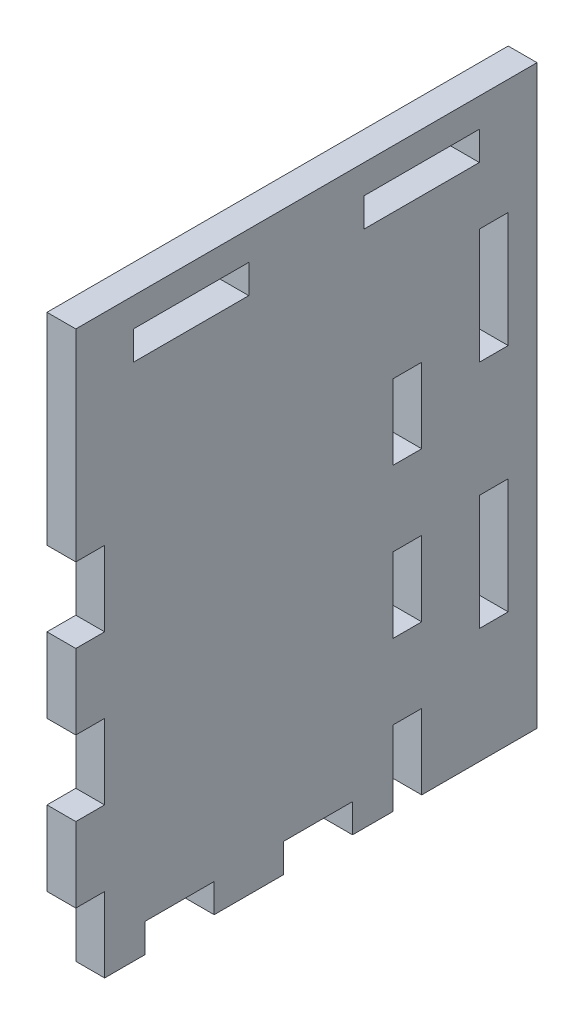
from build123d import *

# Parameters (mm, degrees)
BOSS_EXTRU_1_DEPTH         = 5
ESQUISSE2_W                = 12
ESQUISSE2_H                = 5
ENL_V_MAT_EXTRU_1_DEPTH    = 5
R_P_TITION_LIN_AIRE1_COUNT = 2
R_P_TITION_LIN_AIRE1_PITCH = 24
ESQUISSE4_W                = 5
ESQUISSE4_H                = 13
ENL_V_MAT_EXTRU_2_DEPTH    = 5
R_P_TITION_LIN_AIRE2_COUNT = 3
R_P_TITION_LIN_AIRE2_PITCH = 26
SYM_TRIE1_COPY_1_SKETCH_W  = 5
SYM_TRIE1_COPY_1_SKETCH_H  = 13
SYM_TRIE1_COPY_1_DEPTH     = 5
SYM_TRIE1_COPY_2_SKETCH_W  = 5
SYM_TRIE1_COPY_2_SKETCH_H  = 13
SYM_TRIE1_COPY_2_DEPTH     = 5
BOSS_EXTRU_3_DEPTH         = 5
ESQUISSE7_W                = 20
ESQUISSE7_H                = 5
ENL_V_MAT_EXTRU_3_DEPTH    = 5
ESQUISSE8_W                = 5
ESQUISSE8_H                = 20
ENL_V_MAT_EXTRU_4_DEPTH    = 5


with BuildPart() as part:
    # Esquisse1 → Boss.-Extru.1 (new body)
    with BuildSketch(Plane(origin=(0, 0, 0), x_dir=(0, 0, -1), z_dir=(1, 0, 0))):
        Polygon((0, 0), (0, 35), (45, 35), (45, 0), (60, 0), (60, -65), (0, -65), align=None)
    extrude(amount=BOSS_EXTRU_1_DEPTH)

    # Esquisse2 → Enl_v. mat.-Extru.1 (cut)
    with BuildSketch(Plane(origin=(5, 0, 0), x_dir=(0, 0, -1), z_dir=(1, 0, 0))):
        with Locations((18, -62.5)):
            Rectangle(ESQUISSE2_W, ESQUISSE2_H)
    enl_v_mat_extru_1 = extrude(amount=-ENL_V_MAT_EXTRU_1_DEPTH, mode=Mode.SUBTRACT)

    # R_p_tition lin_aire1: Enl_v. mat.-Extru.1 ×2
    with Locations(*[(0, 0, -i * R_P_TITION_LIN_AIRE1_PITCH) for i in range(1, R_P_TITION_LIN_AIRE1_COUNT)]):
        add(enl_v_mat_extru_1, mode=Mode.SUBTRACT)

    # Esquisse4 → Enl_v. mat.-Extru.2 (cut)
    with BuildSketch(Plane(origin=(5, 0, 0), x_dir=(0, 0, -1), z_dir=(1, 0, 0))):
        with Locations((2.5, -58.5)):
            Rectangle(ESQUISSE4_W, ESQUISSE4_H)
    enl_v_mat_extru_2 = extrude(amount=-ENL_V_MAT_EXTRU_2_DEPTH, mode=Mode.SUBTRACT)

    # R_p_tition lin_aire2: Enl_v. mat.-Extru.2 ×3
    with Locations(*[(0, i * R_P_TITION_LIN_AIRE2_PITCH, 0) for i in range(1, R_P_TITION_LIN_AIRE2_COUNT)]):
        add(enl_v_mat_extru_2, mode=Mode.SUBTRACT)

    # Sym_trie1: Enl_v. mat.-Extru.2 across plane
    add(enl_v_mat_extru_2.mirror(Plane.XY.offset(-30)), mode=Mode.SUBTRACT)

    # Sym_trie1 copy 1 sketch → Sym_trie1 copy 1 (cut)
    with BuildSketch(Plane(origin=(5, 26, -60), x_dir=(0, 0, 1), z_dir=(1, 0, 0))):
        with Locations((2.5, 58.5)):
            Rectangle(SYM_TRIE1_COPY_1_SKETCH_W, SYM_TRIE1_COPY_1_SKETCH_H)
    extrude(amount=-SYM_TRIE1_COPY_1_DEPTH, mode=Mode.SUBTRACT)

    # Sym_trie1 copy 2 sketch → Sym_trie1 copy 2 (cut)
    with BuildSketch(Plane(origin=(5, 52, -60), x_dir=(0, 0, 1), z_dir=(1, 0, 0))):
        with Locations((2.5, 58.5)):
            Rectangle(SYM_TRIE1_COPY_2_SKETCH_W, SYM_TRIE1_COPY_2_SKETCH_H)
    extrude(amount=-SYM_TRIE1_COPY_2_DEPTH, mode=Mode.SUBTRACT)

    # Esquisse5 → Boss.-Extru.3 (add)
    with BuildSketch(Plane(origin=(5, 0, 0), x_dir=(0, 0, -1), z_dir=(1, 0, 0))):
        Polygon((45, 0), (60, 0), (60, -65), (80, -65), (80, 35), (45, 35), align=None)
    extrude(amount=-BOSS_EXTRU_3_DEPTH)

    # Esquisse7 → Enl_v. mat.-Extru.3 (cut)
    with BuildSketch(Plane(origin=(5, 0, 0), x_dir=(0, 0, -1), z_dir=(1, 0, 0))):
        with Locations((20, 27.5)):
            Rectangle(ESQUISSE7_W, ESQUISSE7_H)
        with Locations((60, 27.5)):
            Rectangle(ESQUISSE7_W, ESQUISSE7_H)
    extrude(amount=-ENL_V_MAT_EXTRU_3_DEPTH, mode=Mode.SUBTRACT)

    # Esquisse8 → Enl_v. mat.-Extru.4 (cut)
    with BuildSketch(Plane(origin=(5, 0, 0), x_dir=(0, 0, -1), z_dir=(1, 0, 0))):
        with Locations((72.5, 5)):
            Rectangle(ESQUISSE8_W, ESQUISSE8_H)
        with Locations((72.5, -35)):
            Rectangle(ESQUISSE8_W, ESQUISSE8_H)
    extrude(amount=-ENL_V_MAT_EXTRU_4_DEPTH, mode=Mode.SUBTRACT)


solid = part.part
